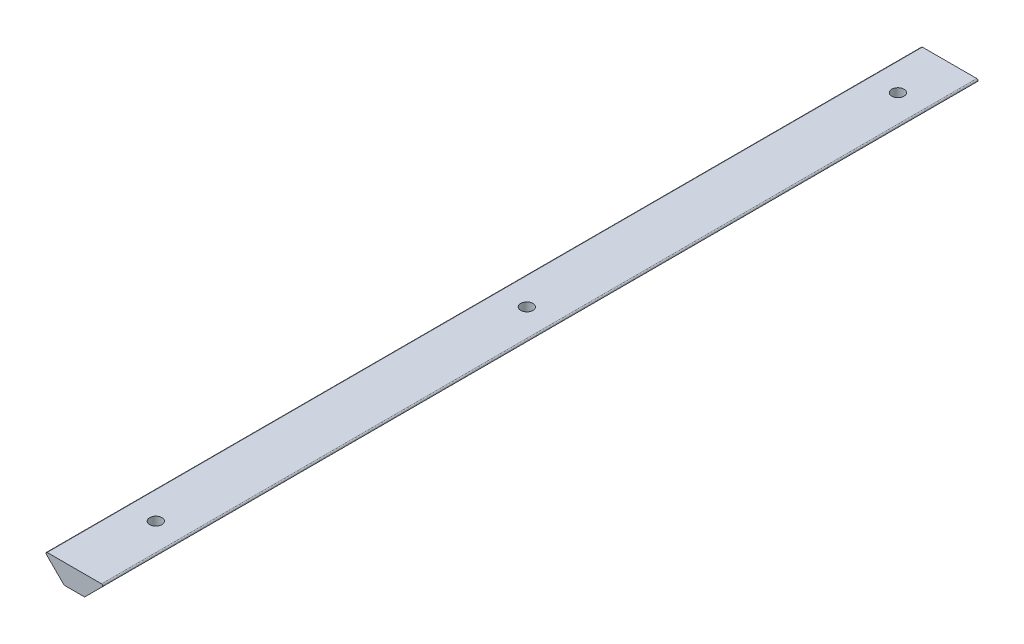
ISO-10303-21;
HEADER;
FILE_DESCRIPTION(('STEP AP214'),'2;1');
FILE_NAME('part.step','',(''),(''),'','','');
FILE_SCHEMA(('AUTOMOTIVE_DESIGN { 1 0 10303 214 1 1 1 1 }'));
ENDSEC;
DATA;
#1=APPLICATION_CONTEXT('core data for automotive mechanical design processes');
#2=APPLICATION_PROTOCOL_DEFINITION('international standard','automotive_design',2000,#1);
#3=PRODUCT_CONTEXT('',#1,'mechanical');
#4=PRODUCT('Part','Part','',(#3));
#5=PRODUCT_RELATED_PRODUCT_CATEGORY('part','',(#4));
#6=PRODUCT_DEFINITION_FORMATION('','',#4);
#7=PRODUCT_DEFINITION_CONTEXT('part definition',#1,'design');
#8=PRODUCT_DEFINITION('design','',#6,#7);
#9=PRODUCT_DEFINITION_SHAPE('','',#8);
#10=(LENGTH_UNIT() NAMED_UNIT(*) SI_UNIT(.MILLI.,.METRE.));
#11=(NAMED_UNIT(*) PLANE_ANGLE_UNIT() SI_UNIT($,.RADIAN.));
#12=(NAMED_UNIT(*) SI_UNIT($,.STERADIAN.) SOLID_ANGLE_UNIT());
#13=UNCERTAINTY_MEASURE_WITH_UNIT(LENGTH_MEASURE(1.E-05),#10,'distance_accuracy_value','');
#14=(GEOMETRIC_REPRESENTATION_CONTEXT(3) GLOBAL_UNCERTAINTY_ASSIGNED_CONTEXT((#13)) GLOBAL_UNIT_ASSIGNED_CONTEXT((#10,
#11,#12)) REPRESENTATION_CONTEXT('',''));
#15=CARTESIAN_POINT('',(0.,0.,0.));
#16=DIRECTION('',(0.,0.,1.));
#17=DIRECTION('',(1.,0.,0.));
#18=AXIS2_PLACEMENT_3D('',#15,#16,#17);
#19=CARTESIAN_POINT('',(3.93223762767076E-13,-21.4866601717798,-202.3));
#20=DIRECTION('',(0.,1.,0.));
#21=DIRECTION('',(-1.,0.,0.));
#22=AXIS2_PLACEMENT_3D('',#19,#20,#21);
#23=CYLINDRICAL_SURFACE('',#22,1.5);
#24=CARTESIAN_POINT('',(-1.5993719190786E-13,8.73933982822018,-202.3));
#25=DIRECTION('',(0.,1.,0.));
#26=DIRECTION('',(-1.,0.,0.));
#27=AXIS2_PLACEMENT_3D('',#24,#25,#26);
#28=CIRCLE('',#27,1.5);
#29=CARTESIAN_POINT('',(-1.50000000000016,8.73933982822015,-202.3));
#30=VERTEX_POINT('',#29);
#31=EDGE_CURVE('E53',#30,#30,#28,.T.);
#32=ORIENTED_EDGE('',*,*,#31,.T.);
#33=EDGE_LOOP('',(#32));
#34=FACE_BOUND('',#33,.T.);
#35=CARTESIAN_POINT('',(0.,3.86,-202.3));
#36=DIRECTION('',(0.,1.,0.));
#37=DIRECTION('',(-1.,0.,0.));
#38=AXIS2_PLACEMENT_3D('',#35,#36,#37);
#39=CIRCLE('',#38,1.5);
#40=CARTESIAN_POINT('',(-1.50000000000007,3.86,-202.3));
#41=VERTEX_POINT('',#40);
#42=EDGE_CURVE('E11',#41,#41,#39,.T.);
#43=ORIENTED_EDGE('',*,*,#42,.F.);
#44=EDGE_LOOP('',(#43));
#45=FACE_BOUND('',#44,.T.);
#46=ADVANCED_FACE('F45',(#34,#45),#23,.F.);
#47=CARTESIAN_POINT('',(-0.671751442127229,0.67175144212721,-215.));
#48=DIRECTION('',(0.707106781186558,-0.707106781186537,0.));
#49=DIRECTION('',(0.707106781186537,0.707106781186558,0.));
#50=AXIS2_PLACEMENT_3D('',#47,#48,#49);
#51=PLANE('',#50);
#52=DIRECTION('',(0.707106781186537,0.707106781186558,0.));
#53=VECTOR('',#52,1.);
#54=CARTESIAN_POINT('',(-0.671751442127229,0.67175144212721,0.));
#55=LINE('',#54,#53);
#56=CARTESIAN_POINT('',(2.51649711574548,3.86000000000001,0.));
#57=VERTEX_POINT('',#56);
#58=CARTESIAN_POINT('',(6.88370490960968,8.22720779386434,0.));
#59=VERTEX_POINT('',#58);
#60=EDGE_CURVE('E134',#57,#59,#55,.T.);
#61=ORIENTED_EDGE('',*,*,#60,.F.);
#62=DIRECTION('',(0.,0.,1.));
#63=VECTOR('',#62,1.);
#64=CARTESIAN_POINT('',(2.51649711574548,3.86000000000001,-215.));
#65=LINE('',#64,#63);
#66=CARTESIAN_POINT('',(2.51649711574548,3.86000000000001,-215.));
#67=VERTEX_POINT('',#66);
#68=EDGE_CURVE('E61',#67,#57,#65,.T.);
#69=ORIENTED_EDGE('',*,*,#68,.F.);
#70=DIRECTION('',(0.707106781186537,0.707106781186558,0.));
#71=VECTOR('',#70,1.);
#72=CARTESIAN_POINT('',(-0.671751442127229,0.67175144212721,-215.));
#73=LINE('',#72,#71);
#74=CARTESIAN_POINT('',(6.88370490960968,8.22720779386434,-215.));
#75=VERTEX_POINT('',#74);
#76=EDGE_CURVE('E148',#67,#75,#73,.T.);
#77=ORIENTED_EDGE('',*,*,#76,.T.);
#78=DIRECTION('',(0.,0.,1.));
#79=VECTOR('',#78,1.);
#80=CARTESIAN_POINT('',(6.88370490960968,8.22720779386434,-215.));
#81=LINE('',#80,#79);
#82=EDGE_CURVE('E93',#75,#59,#81,.T.);
#83=ORIENTED_EDGE('',*,*,#82,.T.);
#84=EDGE_LOOP('',(#61,#69,#77,#83));
#85=FACE_BOUND('',#84,.T.);
#86=ADVANCED_FACE('F175',(#85),#51,.T.);
#87=CARTESIAN_POINT('',(0.,3.86,-215.));
#88=DIRECTION('',(0.,1.,0.));
#89=DIRECTION('',(-1.,0.,0.));
#90=AXIS2_PLACEMENT_3D('',#87,#88,#89);
#91=PLANE('',#90);
#92=CARTESIAN_POINT('',(0.,3.86,-111.15));
#93=DIRECTION('',(0.,1.,0.));
#94=DIRECTION('',(-1.,0.,0.));
#95=AXIS2_PLACEMENT_3D('',#92,#93,#94);
#96=CIRCLE('',#95,1.5);
#97=CARTESIAN_POINT('',(-1.50000000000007,3.86,-111.15));
#98=VERTEX_POINT('',#97);
#99=EDGE_CURVE('E197',#98,#98,#96,.T.);
#100=ORIENTED_EDGE('',*,*,#99,.T.);
#101=EDGE_LOOP('',(#100));
#102=FACE_BOUND('',#101,.T.);
#103=CARTESIAN_POINT('',(0.,3.86,-20.));
#104=DIRECTION('',(0.,1.,0.));
#105=DIRECTION('',(-1.,0.,0.));
#106=AXIS2_PLACEMENT_3D('',#103,#104,#105);
#107=CIRCLE('',#106,1.5);
#108=CARTESIAN_POINT('',(-1.50000000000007,3.86,-20.));
#109=VERTEX_POINT('',#108);
#110=EDGE_CURVE('E138',#109,#109,#107,.T.);
#111=ORIENTED_EDGE('',*,*,#110,.T.);
#112=EDGE_LOOP('',(#111));
#113=FACE_BOUND('',#112,.T.);
#114=DIRECTION('',(-1.,0.,0.));
#115=VECTOR('',#114,1.);
#116=CARTESIAN_POINT('',(0.,3.86,0.));
#117=LINE('',#116,#115);
#118=CARTESIAN_POINT('',(-2.51649711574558,3.85999999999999,0.));
#119=VERTEX_POINT('',#118);
#120=EDGE_CURVE('E84',#57,#119,#117,.T.);
#121=ORIENTED_EDGE('',*,*,#120,.T.);
#122=DIRECTION('',(0.,0.,1.));
#123=VECTOR('',#122,1.);
#124=CARTESIAN_POINT('',(-2.51649711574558,3.85999999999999,-215.));
#125=LINE('',#124,#123);
#126=CARTESIAN_POINT('',(-2.51649711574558,3.85999999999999,-215.));
#127=VERTEX_POINT('',#126);
#128=EDGE_CURVE('E123',#127,#119,#125,.T.);
#129=ORIENTED_EDGE('',*,*,#128,.F.);
#130=DIRECTION('',(-1.,0.,0.));
#131=VECTOR('',#130,1.);
#132=CARTESIAN_POINT('',(0.,3.86,-215.));
#133=LINE('',#132,#131);
#134=EDGE_CURVE('E112',#67,#127,#133,.T.);
#135=ORIENTED_EDGE('',*,*,#134,.F.);
#136=ORIENTED_EDGE('',*,*,#68,.T.);
#137=EDGE_LOOP('',(#121,#129,#135,#136));
#138=FACE_BOUND('',#137,.T.);
#139=ORIENTED_EDGE('',*,*,#42,.T.);
#140=EDGE_LOOP('',(#139));
#141=FACE_BOUND('',#140,.T.);
#142=ADVANCED_FACE('F180',(#102,#113,#138,#141),#91,.F.);
#143=CARTESIAN_POINT('',(0.671751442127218,0.671751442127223,-215.));
#144=DIRECTION('',(0.707106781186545,0.70710678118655,0.));
#145=DIRECTION('',(-0.70710678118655,0.707106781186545,0.));
#146=AXIS2_PLACEMENT_3D('',#143,#144,#145);
#147=PLANE('',#146);
#148=DIRECTION('',(-0.70710678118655,0.707106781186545,0.));
#149=VECTOR('',#148,1.);
#150=CARTESIAN_POINT('',(0.671751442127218,0.671751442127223,0.));
#151=LINE('',#150,#149);
#152=CARTESIAN_POINT('',(-6.88370490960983,8.22720779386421,0.));
#153=VERTEX_POINT('',#152);
#154=EDGE_CURVE('E119',#119,#153,#151,.T.);
#155=ORIENTED_EDGE('',*,*,#154,.T.);
#156=DIRECTION('',(0.,0.,1.));
#157=VECTOR('',#156,1.);
#158=CARTESIAN_POINT('',(-6.88370490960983,8.22720779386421,-215.));
#159=LINE('',#158,#157);
#160=CARTESIAN_POINT('',(-6.88370490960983,8.22720779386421,-215.));
#161=VERTEX_POINT('',#160);
#162=EDGE_CURVE('E116',#161,#153,#159,.T.);
#163=ORIENTED_EDGE('',*,*,#162,.F.);
#164=DIRECTION('',(-0.70710678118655,0.707106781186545,0.));
#165=VECTOR('',#164,1.);
#166=CARTESIAN_POINT('',(0.671751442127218,0.671751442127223,-215.));
#167=LINE('',#166,#165);
#168=EDGE_CURVE('E104',#127,#161,#167,.T.);
#169=ORIENTED_EDGE('',*,*,#168,.F.);
#170=ORIENTED_EDGE('',*,*,#128,.T.);
#171=EDGE_LOOP('',(#155,#163,#169,#170));
#172=FACE_BOUND('',#171,.T.);
#173=ADVANCED_FACE('F117',(#172),#147,.F.);
#174=CARTESIAN_POINT('',(-6.67157287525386,8.43933982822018,-215.));
#175=DIRECTION('',(0.,0.,1.));
#176=DIRECTION('',(1.,0.,0.));
#177=AXIS2_PLACEMENT_3D('',#174,#175,#176);
#178=CYLINDRICAL_SURFACE('',#177,0.300000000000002);
#179=CARTESIAN_POINT('',(-6.67157287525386,8.43933982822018,0.));
#180=DIRECTION('',(0.,0.,1.));
#181=DIRECTION('',(1.,0.,0.));
#182=AXIS2_PLACEMENT_3D('',#179,#180,#181);
#183=CIRCLE('',#182,0.300000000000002);
#184=CARTESIAN_POINT('',(-6.67157287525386,8.73933982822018,0.));
#185=VERTEX_POINT('',#184);
#186=EDGE_CURVE('E144',#185,#153,#183,.T.);
#187=ORIENTED_EDGE('',*,*,#186,.F.);
#188=DIRECTION('',(0.,0.,1.));
#189=VECTOR('',#188,1.);
#190=CARTESIAN_POINT('',(-6.67157287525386,8.73933982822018,-215.));
#191=LINE('',#190,#189);
#192=CARTESIAN_POINT('',(-6.67157287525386,8.73933982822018,-215.));
#193=VERTEX_POINT('',#192);
#194=EDGE_CURVE('E124',#193,#185,#191,.T.);
#195=ORIENTED_EDGE('',*,*,#194,.F.);
#196=CARTESIAN_POINT('',(-6.67157287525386,8.43933982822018,-215.));
#197=DIRECTION('',(0.,0.,1.));
#198=DIRECTION('',(1.,0.,0.));
#199=AXIS2_PLACEMENT_3D('',#196,#197,#198);
#200=CIRCLE('',#199,0.300000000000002);
#201=EDGE_CURVE('E110',#193,#161,#200,.T.);
#202=ORIENTED_EDGE('',*,*,#201,.T.);
#203=ORIENTED_EDGE('',*,*,#162,.T.);
#204=EDGE_LOOP('',(#187,#195,#202,#203));
#205=FACE_BOUND('',#204,.T.);
#206=ADVANCED_FACE('F126',(#205),#178,.T.);
#207=CARTESIAN_POINT('',(-1.5993719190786E-13,8.73933982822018,-215.));
#208=DIRECTION('',(0.,1.,0.));
#209=DIRECTION('',(-1.,0.,0.));
#210=AXIS2_PLACEMENT_3D('',#207,#208,#209);
#211=PLANE('',#210);
#212=CARTESIAN_POINT('',(-1.5993719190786E-13,8.73933982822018,-111.15));
#213=DIRECTION('',(0.,1.,0.));
#214=DIRECTION('',(-1.,0.,0.));
#215=AXIS2_PLACEMENT_3D('',#212,#213,#214);
#216=CIRCLE('',#215,1.5);
#217=CARTESIAN_POINT('',(-1.50000000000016,8.73933982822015,-111.15));
#218=VERTEX_POINT('',#217);
#219=EDGE_CURVE('E200',#218,#218,#216,.T.);
#220=ORIENTED_EDGE('',*,*,#219,.F.);
#221=EDGE_LOOP('',(#220));
#222=FACE_BOUND('',#221,.T.);
#223=CARTESIAN_POINT('',(-1.5993719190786E-13,8.73933982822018,-20.));
#224=DIRECTION('',(0.,1.,0.));
#225=DIRECTION('',(-1.,0.,0.));
#226=AXIS2_PLACEMENT_3D('',#223,#224,#225);
#227=CIRCLE('',#226,1.5);
#228=CARTESIAN_POINT('',(-1.50000000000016,8.73933982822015,-20.));
#229=VERTEX_POINT('',#228);
#230=EDGE_CURVE('E194',#229,#229,#227,.T.);
#231=ORIENTED_EDGE('',*,*,#230,.F.);
#232=EDGE_LOOP('',(#231));
#233=FACE_BOUND('',#232,.T.);
#234=DIRECTION('',(-1.,0.,0.));
#235=VECTOR('',#234,1.);
#236=CARTESIAN_POINT('',(-1.5993719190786E-13,8.73933982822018,0.));
#237=LINE('',#236,#235);
#238=CARTESIAN_POINT('',(6.67157287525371,8.7393398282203,0.));
#239=VERTEX_POINT('',#238);
#240=EDGE_CURVE('E141',#239,#185,#237,.T.);
#241=ORIENTED_EDGE('',*,*,#240,.F.);
#242=DIRECTION('',(0.,0.,1.));
#243=VECTOR('',#242,1.);
#244=CARTESIAN_POINT('',(6.67157287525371,8.7393398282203,-215.));
#245=LINE('',#244,#243);
#246=CARTESIAN_POINT('',(6.67157287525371,8.7393398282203,-215.));
#247=VERTEX_POINT('',#246);
#248=EDGE_CURVE('E152',#247,#239,#245,.T.);
#249=ORIENTED_EDGE('',*,*,#248,.F.);
#250=DIRECTION('',(-1.,0.,0.));
#251=VECTOR('',#250,1.);
#252=CARTESIAN_POINT('',(-1.5993719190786E-13,8.73933982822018,-215.));
#253=LINE('',#252,#251);
#254=EDGE_CURVE('E127',#247,#193,#253,.T.);
#255=ORIENTED_EDGE('',*,*,#254,.T.);
#256=ORIENTED_EDGE('',*,*,#194,.T.);
#257=EDGE_LOOP('',(#241,#249,#255,#256));
#258=FACE_BOUND('',#257,.T.);
#259=ORIENTED_EDGE('',*,*,#31,.F.);
#260=EDGE_LOOP('',(#259));
#261=FACE_BOUND('',#260,.T.);
#262=ADVANCED_FACE('F159',(#222,#233,#258,#261),#211,.T.);
#263=CARTESIAN_POINT('',(6.67157287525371,8.4393398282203,-215.));
#264=DIRECTION('',(0.,0.,1.));
#265=DIRECTION('',(1.,0.,0.));
#266=AXIS2_PLACEMENT_3D('',#263,#264,#265);
#267=CYLINDRICAL_SURFACE('',#266,0.300000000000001);
#268=CARTESIAN_POINT('',(6.67157287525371,8.4393398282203,0.));
#269=DIRECTION('',(0.,0.,1.));
#270=DIRECTION('',(1.,0.,0.));
#271=AXIS2_PLACEMENT_3D('',#268,#269,#270);
#272=CIRCLE('',#271,0.300000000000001);
#273=EDGE_CURVE('E137',#59,#239,#272,.T.);
#274=ORIENTED_EDGE('',*,*,#273,.F.);
#275=ORIENTED_EDGE('',*,*,#82,.F.);
#276=CARTESIAN_POINT('',(6.67157287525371,8.4393398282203,-215.));
#277=DIRECTION('',(0.,0.,1.));
#278=DIRECTION('',(1.,0.,0.));
#279=AXIS2_PLACEMENT_3D('',#276,#277,#278);
#280=CIRCLE('',#279,0.300000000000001);
#281=EDGE_CURVE('E129',#75,#247,#280,.T.);
#282=ORIENTED_EDGE('',*,*,#281,.T.);
#283=ORIENTED_EDGE('',*,*,#248,.T.);
#284=EDGE_LOOP('',(#274,#275,#282,#283));
#285=FACE_BOUND('',#284,.T.);
#286=ADVANCED_FACE('F161',(#285),#267,.T.);
#287=CARTESIAN_POINT('',(0.,0.,-215.));
#288=DIRECTION('',(0.,0.,1.));
#289=DIRECTION('',(1.,0.,0.));
#290=AXIS2_PLACEMENT_3D('',#287,#288,#289);
#291=PLANE('',#290);
#292=ORIENTED_EDGE('',*,*,#76,.F.);
#293=ORIENTED_EDGE('',*,*,#134,.T.);
#294=ORIENTED_EDGE('',*,*,#168,.T.);
#295=ORIENTED_EDGE('',*,*,#201,.F.);
#296=ORIENTED_EDGE('',*,*,#254,.F.);
#297=ORIENTED_EDGE('',*,*,#281,.F.);
#298=EDGE_LOOP('',(#292,#293,#294,#295,#296,#297));
#299=FACE_BOUND('',#298,.T.);
#300=ADVANCED_FACE('F107',(#299),#291,.F.);
#301=CARTESIAN_POINT('',(0.,0.,0.));
#302=DIRECTION('',(0.,0.,1.));
#303=DIRECTION('',(1.,0.,0.));
#304=AXIS2_PLACEMENT_3D('',#301,#302,#303);
#305=PLANE('',#304);
#306=ORIENTED_EDGE('',*,*,#60,.T.);
#307=ORIENTED_EDGE('',*,*,#273,.T.);
#308=ORIENTED_EDGE('',*,*,#240,.T.);
#309=ORIENTED_EDGE('',*,*,#186,.T.);
#310=ORIENTED_EDGE('',*,*,#154,.F.);
#311=ORIENTED_EDGE('',*,*,#120,.F.);
#312=EDGE_LOOP('',(#306,#307,#308,#309,#310,#311));
#313=FACE_BOUND('',#312,.T.);
#314=ADVANCED_FACE('F187',(#313),#305,.T.);
#315=CARTESIAN_POINT('',(3.93223762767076E-13,-21.4866601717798,-20.));
#316=DIRECTION('',(0.,1.,0.));
#317=DIRECTION('',(-1.,0.,0.));
#318=AXIS2_PLACEMENT_3D('',#315,#316,#317);
#319=CYLINDRICAL_SURFACE('',#318,1.5);
#320=ORIENTED_EDGE('',*,*,#230,.T.);
#321=EDGE_LOOP('',(#320));
#322=FACE_BOUND('',#321,.T.);
#323=ORIENTED_EDGE('',*,*,#110,.F.);
#324=EDGE_LOOP('',(#323));
#325=FACE_BOUND('',#324,.T.);
#326=ADVANCED_FACE('F205',(#322,#325),#319,.F.);
#327=CARTESIAN_POINT('',(3.93223762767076E-13,-21.4866601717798,-111.15));
#328=DIRECTION('',(0.,1.,0.));
#329=DIRECTION('',(-1.,0.,0.));
#330=AXIS2_PLACEMENT_3D('',#327,#328,#329);
#331=CYLINDRICAL_SURFACE('',#330,1.5);
#332=ORIENTED_EDGE('',*,*,#219,.T.);
#333=EDGE_LOOP('',(#332));
#334=FACE_BOUND('',#333,.T.);
#335=ORIENTED_EDGE('',*,*,#99,.F.);
#336=EDGE_LOOP('',(#335));
#337=FACE_BOUND('',#336,.T.);
#338=ADVANCED_FACE('F203',(#334,#337),#331,.F.);
#339=CLOSED_SHELL('',(#46,#86,#142,#173,#206,#262,#286,#300,#314,#326,#338));
#340=MANIFOLD_SOLID_BREP('B2',#339);
#341=ADVANCED_BREP_SHAPE_REPRESENTATION('',(#18,#340),#14);
#342=SHAPE_DEFINITION_REPRESENTATION(#9,#341);
ENDSEC;
END-ISO-10303-21;
